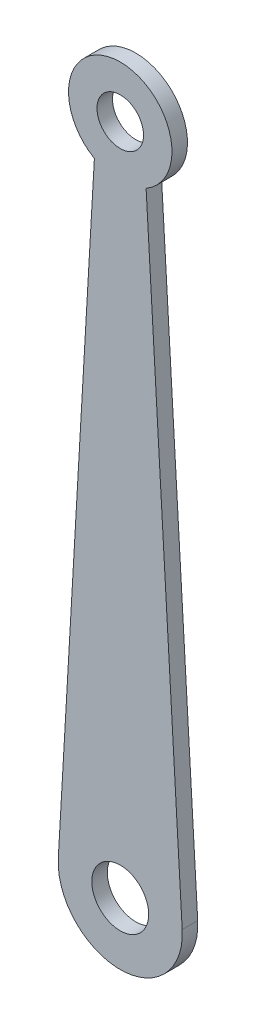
ISO-10303-21;
HEADER;
FILE_DESCRIPTION(('STEP AP214'),'2;1');
FILE_NAME('part.step','',(''),(''),'','','');
FILE_SCHEMA(('AUTOMOTIVE_DESIGN { 1 0 10303 214 1 1 1 1 }'));
ENDSEC;
DATA;
#1=APPLICATION_CONTEXT('core data for automotive mechanical design processes');
#2=APPLICATION_PROTOCOL_DEFINITION('international standard','automotive_design',2000,#1);
#3=PRODUCT_CONTEXT('',#1,'mechanical');
#4=PRODUCT('Part','Part','',(#3));
#5=PRODUCT_RELATED_PRODUCT_CATEGORY('part','',(#4));
#6=PRODUCT_DEFINITION_FORMATION('','',#4);
#7=PRODUCT_DEFINITION_CONTEXT('part definition',#1,'design');
#8=PRODUCT_DEFINITION('design','',#6,#7);
#9=PRODUCT_DEFINITION_SHAPE('','',#8);
#10=(LENGTH_UNIT() NAMED_UNIT(*) SI_UNIT(.MILLI.,.METRE.));
#11=(NAMED_UNIT(*) PLANE_ANGLE_UNIT() SI_UNIT($,.RADIAN.));
#12=(NAMED_UNIT(*) SI_UNIT($,.STERADIAN.) SOLID_ANGLE_UNIT());
#13=UNCERTAINTY_MEASURE_WITH_UNIT(LENGTH_MEASURE(1.E-05),#10,'distance_accuracy_value','');
#14=(GEOMETRIC_REPRESENTATION_CONTEXT(3) GLOBAL_UNCERTAINTY_ASSIGNED_CONTEXT((#13)) GLOBAL_UNIT_ASSIGNED_CONTEXT((#10,
#11,#12)) REPRESENTATION_CONTEXT('',''));
#15=CARTESIAN_POINT('',(0.,0.,0.));
#16=DIRECTION('',(0.,0.,1.));
#17=DIRECTION('',(1.,0.,0.));
#18=AXIS2_PLACEMENT_3D('',#15,#16,#17);
#19=CARTESIAN_POINT('',(0.,65.0000007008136,1.5));
#20=DIRECTION('',(0.,0.,1.));
#21=DIRECTION('',(1.,0.,0.));
#22=AXIS2_PLACEMENT_3D('',#19,#20,#21);
#23=PLANE('',#22);
#24=CARTESIAN_POINT('',(0.,65.0000007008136,1.5));
#25=DIRECTION('',(0.,0.,1.));
#26=DIRECTION('',(1.,0.,0.));
#27=AXIS2_PLACEMENT_3D('',#24,#25,#26);
#28=CIRCLE('',#27,2.25);
#29=CARTESIAN_POINT('',(2.25,65.0000007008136,1.5));
#30=VERTEX_POINT('',#29);
#31=EDGE_CURVE('E89',#30,#30,#28,.T.);
#32=ORIENTED_EDGE('',*,*,#31,.F.);
#33=EDGE_LOOP('',(#32));
#34=FACE_BOUND('',#33,.T.);
#35=CARTESIAN_POINT('',(0.,65.0000007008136,1.5));
#36=DIRECTION('',(0.,0.,1.));
#37=DIRECTION('',(1.,0.,0.));
#38=AXIS2_PLACEMENT_3D('',#35,#36,#37);
#39=CIRCLE('',#38,5.0000060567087);
#40=CARTESIAN_POINT('',(2.50001211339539,60.6698736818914,1.5));
#41=VERTEX_POINT('',#40);
#42=CARTESIAN_POINT('',(-2.50001211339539,60.6698736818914,1.5));
#43=VERTEX_POINT('',#42);
#44=EDGE_CURVE('E99',#41,#43,#39,.T.);
#45=ORIENTED_EDGE('',*,*,#44,.T.);
#46=DIRECTION('',(-0.0577578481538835,-0.998330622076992,0.));
#47=VECTOR('',#46,1.);
#48=CARTESIAN_POINT('',(-2.50001211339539,60.6698736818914,1.5));
#49=LINE('',#48,#47);
#50=CARTESIAN_POINT('',(-5.98998373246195,0.346547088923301,1.5));
#51=VERTEX_POINT('',#50);
#52=EDGE_CURVE('E84',#43,#51,#49,.T.);
#53=ORIENTED_EDGE('',*,*,#52,.T.);
#54=CARTESIAN_POINT('',(0.,0.,1.5));
#55=DIRECTION('',(0.,0.,1.));
#56=DIRECTION('',(1.,0.,0.));
#57=AXIS2_PLACEMENT_3D('',#54,#55,#56);
#58=CIRCLE('',#57,6.);
#59=CARTESIAN_POINT('',(5.98998373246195,0.3465470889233,1.5));
#60=VERTEX_POINT('',#59);
#61=EDGE_CURVE('E50',#51,#60,#58,.T.);
#62=ORIENTED_EDGE('',*,*,#61,.T.);
#63=DIRECTION('',(-0.0577578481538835,0.998330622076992,0.));
#64=VECTOR('',#63,1.);
#65=CARTESIAN_POINT('',(2.50001211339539,60.6698736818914,1.5));
#66=LINE('',#65,#64);
#67=EDGE_CURVE('E45',#60,#41,#66,.T.);
#68=ORIENTED_EDGE('',*,*,#67,.T.);
#69=EDGE_LOOP('',(#45,#53,#62,#68));
#70=FACE_BOUND('',#69,.T.);
#71=CARTESIAN_POINT('',(0.,0.,1.5));
#72=DIRECTION('',(0.,0.,1.));
#73=DIRECTION('',(1.,0.,0.));
#74=AXIS2_PLACEMENT_3D('',#71,#72,#73);
#75=CIRCLE('',#74,2.75);
#76=CARTESIAN_POINT('',(2.75,0.,1.5));
#77=VERTEX_POINT('',#76);
#78=EDGE_CURVE('E117',#77,#77,#75,.T.);
#79=ORIENTED_EDGE('',*,*,#78,.F.);
#80=EDGE_LOOP('',(#79));
#81=FACE_BOUND('',#80,.T.);
#82=ADVANCED_FACE('F30',(#34,#70,#81),#23,.T.);
#83=CARTESIAN_POINT('',(0.,65.0000007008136,0.));
#84=DIRECTION('',(0.,0.,1.));
#85=DIRECTION('',(1.,0.,0.));
#86=AXIS2_PLACEMENT_3D('',#83,#84,#85);
#87=PLANE('',#86);
#88=CARTESIAN_POINT('',(0.,65.0000007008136,0.));
#89=DIRECTION('',(0.,0.,1.));
#90=DIRECTION('',(1.,0.,0.));
#91=AXIS2_PLACEMENT_3D('',#88,#89,#90);
#92=CIRCLE('',#91,2.25);
#93=CARTESIAN_POINT('',(2.25,65.0000007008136,0.));
#94=VERTEX_POINT('',#93);
#95=EDGE_CURVE('E92',#94,#94,#92,.T.);
#96=ORIENTED_EDGE('',*,*,#95,.T.);
#97=EDGE_LOOP('',(#96));
#98=FACE_BOUND('',#97,.T.);
#99=CARTESIAN_POINT('',(0.,65.0000007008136,0.));
#100=DIRECTION('',(0.,0.,1.));
#101=DIRECTION('',(1.,0.,0.));
#102=AXIS2_PLACEMENT_3D('',#99,#100,#101);
#103=CIRCLE('',#102,5.0000060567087);
#104=CARTESIAN_POINT('',(2.50001211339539,60.6698736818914,0.));
#105=VERTEX_POINT('',#104);
#106=CARTESIAN_POINT('',(-2.50001211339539,60.6698736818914,0.));
#107=VERTEX_POINT('',#106);
#108=EDGE_CURVE('E76',#105,#107,#103,.T.);
#109=ORIENTED_EDGE('',*,*,#108,.F.);
#110=DIRECTION('',(-0.0577578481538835,0.998330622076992,0.));
#111=VECTOR('',#110,1.);
#112=CARTESIAN_POINT('',(2.50001211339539,60.6698736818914,0.));
#113=LINE('',#112,#111);
#114=CARTESIAN_POINT('',(5.98998373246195,0.3465470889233,0.));
#115=VERTEX_POINT('',#114);
#116=EDGE_CURVE('E97',#115,#105,#113,.T.);
#117=ORIENTED_EDGE('',*,*,#116,.F.);
#118=CARTESIAN_POINT('',(0.,0.,0.));
#119=DIRECTION('',(0.,0.,1.));
#120=DIRECTION('',(1.,0.,0.));
#121=AXIS2_PLACEMENT_3D('',#118,#119,#120);
#122=CIRCLE('',#121,6.);
#123=CARTESIAN_POINT('',(-5.98998373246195,0.346547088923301,0.));
#124=VERTEX_POINT('',#123);
#125=EDGE_CURVE('E77',#124,#115,#122,.T.);
#126=ORIENTED_EDGE('',*,*,#125,.F.);
#127=DIRECTION('',(-0.0577578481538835,-0.998330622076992,0.));
#128=VECTOR('',#127,1.);
#129=CARTESIAN_POINT('',(-2.50001211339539,60.6698736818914,0.));
#130=LINE('',#129,#128);
#131=EDGE_CURVE('E71',#107,#124,#130,.T.);
#132=ORIENTED_EDGE('',*,*,#131,.F.);
#133=EDGE_LOOP('',(#109,#117,#126,#132));
#134=FACE_BOUND('',#133,.T.);
#135=CARTESIAN_POINT('',(0.,0.,0.));
#136=DIRECTION('',(0.,0.,1.));
#137=DIRECTION('',(1.,0.,0.));
#138=AXIS2_PLACEMENT_3D('',#135,#136,#137);
#139=CIRCLE('',#138,2.75);
#140=CARTESIAN_POINT('',(2.75,0.,0.));
#141=VERTEX_POINT('',#140);
#142=EDGE_CURVE('E119',#141,#141,#139,.T.);
#143=ORIENTED_EDGE('',*,*,#142,.T.);
#144=EDGE_LOOP('',(#143));
#145=FACE_BOUND('',#144,.T.);
#146=ADVANCED_FACE('F72',(#98,#134,#145),#87,.F.);
#147=CARTESIAN_POINT('',(0.,65.0000007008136,1.5));
#148=DIRECTION('',(0.,0.,-1.));
#149=DIRECTION('',(-1.,0.,0.));
#150=AXIS2_PLACEMENT_3D('',#147,#148,#149);
#151=CYLINDRICAL_SURFACE('',#150,5.0000060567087);
#152=ORIENTED_EDGE('',*,*,#108,.T.);
#153=DIRECTION('',(0.,0.,-1.));
#154=VECTOR('',#153,1.);
#155=CARTESIAN_POINT('',(-2.50001211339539,60.6698736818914,1.5));
#156=LINE('',#155,#154);
#157=EDGE_CURVE('E11',#43,#107,#156,.T.);
#158=ORIENTED_EDGE('',*,*,#157,.F.);
#159=ORIENTED_EDGE('',*,*,#44,.F.);
#160=DIRECTION('',(0.,0.,-1.));
#161=VECTOR('',#160,1.);
#162=CARTESIAN_POINT('',(2.50001211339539,60.6698736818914,1.5));
#163=LINE('',#162,#161);
#164=EDGE_CURVE('E88',#41,#105,#163,.T.);
#165=ORIENTED_EDGE('',*,*,#164,.T.);
#166=EDGE_LOOP('',(#152,#158,#159,#165));
#167=FACE_BOUND('',#166,.T.);
#168=ADVANCED_FACE('F32',(#167),#151,.T.);
#169=CARTESIAN_POINT('',(-2.50001211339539,60.6698736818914,1.5));
#170=DIRECTION('',(0.998330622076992,-0.0577578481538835,0.));
#171=DIRECTION('',(0.0577578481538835,0.998330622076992,0.));
#172=AXIS2_PLACEMENT_3D('',#169,#170,#171);
#173=PLANE('',#172);
#174=ORIENTED_EDGE('',*,*,#131,.T.);
#175=DIRECTION('',(0.,0.,-1.));
#176=VECTOR('',#175,1.);
#177=CARTESIAN_POINT('',(-5.98998373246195,0.346547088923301,1.5));
#178=LINE('',#177,#176);
#179=EDGE_CURVE('E38',#51,#124,#178,.T.);
#180=ORIENTED_EDGE('',*,*,#179,.F.);
#181=ORIENTED_EDGE('',*,*,#52,.F.);
#182=ORIENTED_EDGE('',*,*,#157,.T.);
#183=EDGE_LOOP('',(#174,#180,#181,#182));
#184=FACE_BOUND('',#183,.T.);
#185=ADVANCED_FACE('F83',(#184),#173,.F.);
#186=CARTESIAN_POINT('',(0.,0.,1.5));
#187=DIRECTION('',(0.,0.,-1.));
#188=DIRECTION('',(-1.,0.,0.));
#189=AXIS2_PLACEMENT_3D('',#186,#187,#188);
#190=CYLINDRICAL_SURFACE('',#189,6.);
#191=ORIENTED_EDGE('',*,*,#125,.T.);
#192=DIRECTION('',(0.,0.,-1.));
#193=VECTOR('',#192,1.);
#194=CARTESIAN_POINT('',(5.98998373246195,0.3465470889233,1.5));
#195=LINE('',#194,#193);
#196=EDGE_CURVE('E105',#60,#115,#195,.T.);
#197=ORIENTED_EDGE('',*,*,#196,.F.);
#198=ORIENTED_EDGE('',*,*,#61,.F.);
#199=ORIENTED_EDGE('',*,*,#179,.T.);
#200=EDGE_LOOP('',(#191,#197,#198,#199));
#201=FACE_BOUND('',#200,.T.);
#202=ADVANCED_FACE('F108',(#201),#190,.T.);
#203=CARTESIAN_POINT('',(2.50001211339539,60.6698736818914,1.5));
#204=DIRECTION('',(-0.998330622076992,-0.0577578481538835,0.));
#205=DIRECTION('',(0.0577578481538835,-0.998330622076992,0.));
#206=AXIS2_PLACEMENT_3D('',#203,#204,#205);
#207=PLANE('',#206);
#208=ORIENTED_EDGE('',*,*,#116,.T.);
#209=ORIENTED_EDGE('',*,*,#164,.F.);
#210=ORIENTED_EDGE('',*,*,#67,.F.);
#211=ORIENTED_EDGE('',*,*,#196,.T.);
#212=EDGE_LOOP('',(#208,#209,#210,#211));
#213=FACE_BOUND('',#212,.T.);
#214=ADVANCED_FACE('F110',(#213),#207,.F.);
#215=CARTESIAN_POINT('',(0.,65.0000007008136,1.5));
#216=DIRECTION('',(0.,0.,-1.));
#217=DIRECTION('',(-1.,0.,0.));
#218=AXIS2_PLACEMENT_3D('',#215,#216,#217);
#219=CYLINDRICAL_SURFACE('',#218,2.25);
#220=ORIENTED_EDGE('',*,*,#31,.T.);
#221=EDGE_LOOP('',(#220));
#222=FACE_BOUND('',#221,.T.);
#223=ORIENTED_EDGE('',*,*,#95,.F.);
#224=EDGE_LOOP('',(#223));
#225=FACE_BOUND('',#224,.T.);
#226=ADVANCED_FACE('F128',(#222,#225),#219,.F.);
#227=CARTESIAN_POINT('',(0.,0.,1.5));
#228=DIRECTION('',(0.,0.,-1.));
#229=DIRECTION('',(-1.,0.,0.));
#230=AXIS2_PLACEMENT_3D('',#227,#228,#229);
#231=CYLINDRICAL_SURFACE('',#230,2.75);
#232=ORIENTED_EDGE('',*,*,#78,.T.);
#233=EDGE_LOOP('',(#232));
#234=FACE_BOUND('',#233,.T.);
#235=ORIENTED_EDGE('',*,*,#142,.F.);
#236=EDGE_LOOP('',(#235));
#237=FACE_BOUND('',#236,.T.);
#238=ADVANCED_FACE('F126',(#234,#237),#231,.F.);
#239=CLOSED_SHELL('',(#82,#146,#168,#185,#202,#214,#226,#238));
#240=MANIFOLD_SOLID_BREP('B2',#239);
#241=ADVANCED_BREP_SHAPE_REPRESENTATION('',(#18,#240),#14);
#242=SHAPE_DEFINITION_REPRESENTATION(#9,#241);
ENDSEC;
END-ISO-10303-21;
